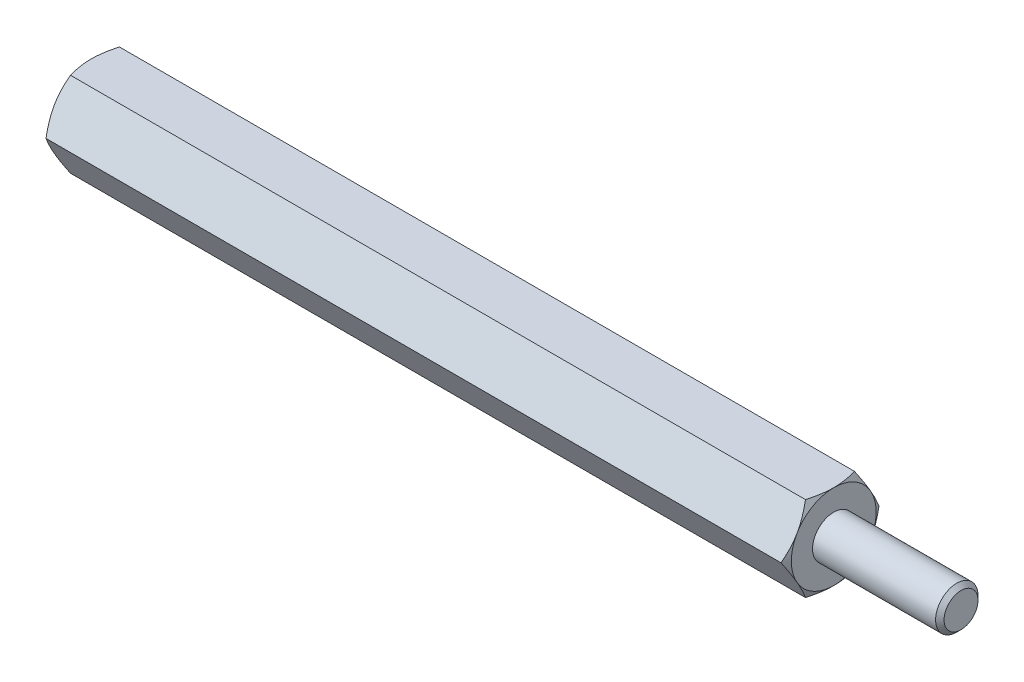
from build123d import *

# Parameters (mm, degrees)
EXTRUDE2_DEPTH = 17.5
SKETCH3_R      = 0.8
EXTRUDE3_DEPTH = 6
SKETCH5_R      = 1
EXTRUDE4_DEPTH = 6
CHAMFER1_SIZE  = 0.2


with BuildPart() as part:
    # Sketch1 → Extrude2 (new, symmetric)
    with BuildSketch(Plane(origin=(0, 0, 0), x_dir=(0, 0, -1), z_dir=(1, 0, 0))):
        Polygon((1.154700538, 2), (-1.154700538, 2), (-2.309401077, 0), (-1.154700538, -2), (1.154700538, -2), (2.309401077, 0), align=None)
    extrude(amount=EXTRUDE2_DEPTH, both=True)

    # Sketch2 → Cut-Revolve1 (revolve, cut)
    with BuildSketch(Plane.XY):
        with BuildLine():
            Line((-17.5, 2), (-16, 4.598076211))
            ThreePointArc((-16, 4.598076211), (-16.48810136, 5.776457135), (-17.5, 5))
            Line((-17.5, 5), (-17.5, 2))
        make_face()
    cut_revolve1 = revolve(axis=Axis((0, 0, 0), (1, 0, 0)), mode=Mode.SUBTRACT)

    # Mirror1: Cut-Revolve1 across plane
    add(cut_revolve1.mirror(Plane(origin=(0, 0, 0), x_dir=(0, 0, 1), z_dir=(1, 0, 0))), mode=Mode.SUBTRACT)

    # Sketch3 → Extrude3 (cut)
    with BuildSketch(Plane.ZY.offset(17.5)):
        Circle(SKETCH3_R)
    extrude(amount=-EXTRUDE3_DEPTH, mode=Mode.SUBTRACT)

    # Sketch4 → Cut-Revolve2 (revolve, cut)
    with BuildSketch(Plane.XY, mode=Mode.PRIVATE) as cut_revolve2_sk:
        Polygon((-11.5, 0), (-11.5, 0.8), (-11.038119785, 0), align=None)
    revolve(cut_revolve2_sk.sketch.rotate(Axis((-11.038119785, 0, 0), (-1, 0, 0)), 270), axis=Axis((-11.038119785, 0, 0), (-1, 0, 0)), mode=Mode.SUBTRACT)

    # Sketch5 → Extrude4 (add)
    with BuildSketch(Plane(origin=(17.5, 0, 0), x_dir=(0, 0, -1), z_dir=(1, 0, 0))):
        Circle(SKETCH5_R)
    extrude(amount=EXTRUDE4_DEPTH)

    # Chamfer1
    chamfer1_edges = [part.edges().sort_by_distance(p)[0] for p in [
        (23.5, 0, 1),
    ]]
    chamfer(chamfer1_edges, length=CHAMFER1_SIZE)


solid = part.part
